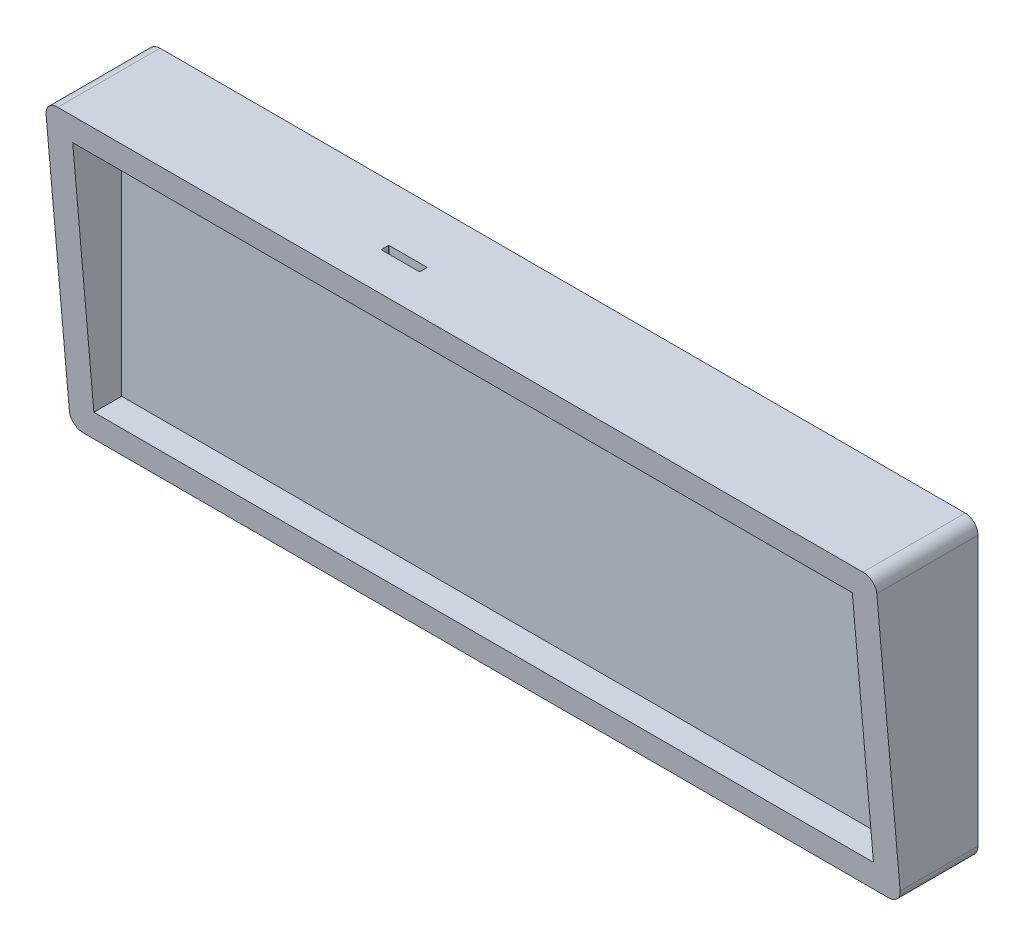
from build123d import *

# Parameters (mm, degrees)
SKETCH2_W           = 324.8
SKETCH2_H           = 115.25
BOSS_EXTRUDE1_DEPTH = 40
SKETCH3_W           = 304.8
SKETCH3_H           = 95.45
CUT_EXTRUDE1_DEPTH  = 20
CUT_EXTRUDE2_DEPTH  = 324.8
SKETCH5_W           = 15
SKETCH5_H           = 3
CUT_EXTRUDE6_DEPTH  = 50
FILLET2_R           = 5
FILLET3_R           = 0.1
FILLET4_R           = 0.1
FILLET5_R           = 0.1
FILLET6_R           = 0.1


with BuildPart() as part:
    # Sketch2 → Boss-Extrude1 (new body)
    with BuildSketch(Plane.XY):
        Rectangle(SKETCH2_W, SKETCH2_H)
    extrude(amount=BOSS_EXTRUDE1_DEPTH)

    # Sketch3 → Cut-Extrude1 (cut)
    with BuildSketch(Plane.XY.offset(40)):
        Rectangle(SKETCH3_W, SKETCH3_H)
    extrude(amount=-CUT_EXTRUDE1_DEPTH, mode=Mode.SUBTRACT)

    # Sketch4 → Cut-Extrude2 (cut)
    with BuildSketch(Plane.ZY.offset(162.4)):
        Polygon((30, -57.625), (40, 57.625), (40, -57.625), align=None)
    extrude(amount=-CUT_EXTRUDE2_DEPTH, mode=Mode.SUBTRACT)

    # Sketch5 → Cut-Extrude6 (cut)
    with BuildSketch(Plane(origin=(0, 57.625, 0), x_dir=(1, 0, 0), z_dir=(0, 1, 0))):
        with Locations((-38.45, -23.5)):
            Rectangle(SKETCH5_W, SKETCH5_H)
    extrude(amount=-CUT_EXTRUDE6_DEPTH, mode=Mode.SUBTRACT)

    # Fillet2
    fillet2_edges = [part.edges().sort_by_distance(p)[0] for p in [
        (162.4, -57.625, 15),
        (-162.4, -57.625, 15),
        (-162.4, 57.625, 20),
        (162.4, 57.625, 20),
    ]]
    fillet(fillet2_edges, radius=FILLET2_R)

    # Fillet3
    fillet3_edges = [part.edges().sort_by_distance(p)[0] for p in [
        (-45.95, 52.675, 25),
    ]]
    fillet(fillet3_edges, radius=FILLET3_R)

    # Fillet4
    fillet4_edges = [part.edges().sort_by_distance(p)[0] for p in [
        (-30.95, 52.675, 22),
    ]]
    fillet(fillet4_edges, radius=FILLET4_R)

    # Fillet5
    fillet5_edges = [part.edges().sort_by_distance(p)[0] for p in [
        (-30.95, 52.675, 25),
    ]]
    fillet(fillet5_edges, radius=FILLET5_R)

    # Fillet6
    fillet6_edges = [part.edges().sort_by_distance(p)[0] for p in [
        (-45.95, 52.675, 22),
    ]]
    fillet(fillet6_edges, radius=FILLET6_R)


solid = part.part
